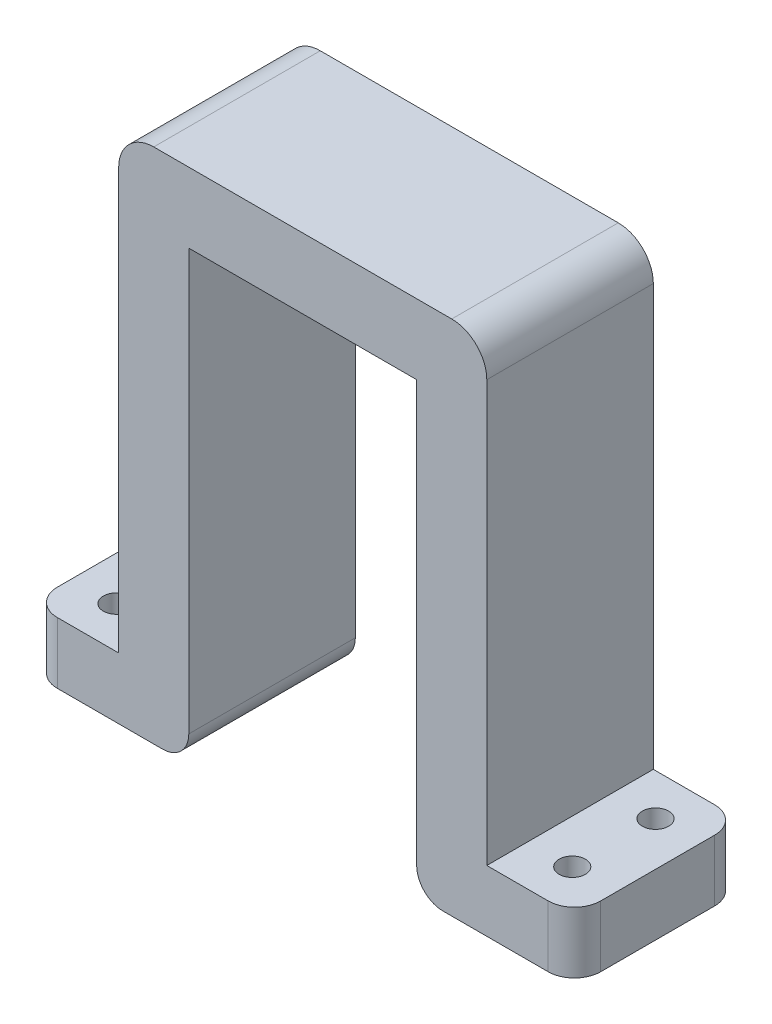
ISO-10303-21;
HEADER;
FILE_DESCRIPTION(('STEP AP214'),'2;1');
FILE_NAME('part.step','',(''),(''),'','','');
FILE_SCHEMA(('AUTOMOTIVE_DESIGN { 1 0 10303 214 1 1 1 1 }'));
ENDSEC;
DATA;
#1=APPLICATION_CONTEXT('core data for automotive mechanical design processes');
#2=APPLICATION_PROTOCOL_DEFINITION('international standard','automotive_design',2000,#1);
#3=PRODUCT_CONTEXT('',#1,'mechanical');
#4=PRODUCT('Part','Part','',(#3));
#5=PRODUCT_RELATED_PRODUCT_CATEGORY('part','',(#4));
#6=PRODUCT_DEFINITION_FORMATION('','',#4);
#7=PRODUCT_DEFINITION_CONTEXT('part definition',#1,'design');
#8=PRODUCT_DEFINITION('design','',#6,#7);
#9=PRODUCT_DEFINITION_SHAPE('','',#8);
#10=(LENGTH_UNIT() NAMED_UNIT(*) SI_UNIT(.MILLI.,.METRE.));
#11=(NAMED_UNIT(*) PLANE_ANGLE_UNIT() SI_UNIT($,.RADIAN.));
#12=(NAMED_UNIT(*) SI_UNIT($,.STERADIAN.) SOLID_ANGLE_UNIT());
#13=UNCERTAINTY_MEASURE_WITH_UNIT(LENGTH_MEASURE(1.E-05),#10,'distance_accuracy_value','');
#14=(GEOMETRIC_REPRESENTATION_CONTEXT(3) GLOBAL_UNCERTAINTY_ASSIGNED_CONTEXT((#13)) GLOBAL_UNIT_ASSIGNED_CONTEXT((#10,
#11,#12)) REPRESENTATION_CONTEXT('',''));
#15=CARTESIAN_POINT('',(0.,0.,0.));
#16=DIRECTION('',(0.,0.,1.));
#17=DIRECTION('',(1.,0.,0.));
#18=AXIS2_PLACEMENT_3D('',#15,#16,#17);
#19=CARTESIAN_POINT('',(-11.7832512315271,-43.5073891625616,19.));
#20=DIRECTION('',(0.,-1.,0.));
#21=DIRECTION('',(0.,0.,-1.));
#22=AXIS2_PLACEMENT_3D('',#19,#20,#21);
#23=PLANE('',#22);
#24=CARTESIAN_POINT('',(-24.7832512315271,-43.5073891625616,4.75));
#25=DIRECTION('',(0.,1.,0.));
#26=DIRECTION('',(0.,0.,1.));
#27=AXIS2_PLACEMENT_3D('',#24,#25,#26);
#28=CIRCLE('',#27,1.5);
#29=CARTESIAN_POINT('',(-24.7832512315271,-43.5073891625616,6.25));
#30=VERTEX_POINT('',#29);
#31=EDGE_CURVE('E643',#30,#30,#28,.T.);
#32=ORIENTED_EDGE('',*,*,#31,.T.);
#33=EDGE_LOOP('',(#32));
#34=FACE_BOUND('',#33,.T.);
#35=CARTESIAN_POINT('',(-24.7832512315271,-43.5073891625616,14.25));
#36=DIRECTION('',(0.,-1.,0.));
#37=DIRECTION('',(0.,0.,-1.));
#38=AXIS2_PLACEMENT_3D('',#35,#36,#37);
#39=CIRCLE('',#38,1.5);
#40=CARTESIAN_POINT('',(-24.7832512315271,-43.5073891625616,15.75));
#41=VERTEX_POINT('',#40);
#42=EDGE_CURVE('E634',#41,#41,#39,.T.);
#43=ORIENTED_EDGE('',*,*,#42,.F.);
#44=EDGE_LOOP('',(#43));
#45=FACE_BOUND('',#44,.T.);
#46=DIRECTION('',(-1.,0.,0.));
#47=VECTOR('',#46,1.);
#48=CARTESIAN_POINT('',(-11.7832512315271,-43.5073891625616,0.));
#49=LINE('',#48,#47);
#50=CARTESIAN_POINT('',(-14.7832512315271,-43.5073891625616,0.));
#51=VERTEX_POINT('',#50);
#52=CARTESIAN_POINT('',(-26.7832512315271,-43.5073891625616,0.));
#53=VERTEX_POINT('',#52);
#54=EDGE_CURVE('E212',#51,#53,#49,.T.);
#55=ORIENTED_EDGE('',*,*,#54,.F.);
#56=DIRECTION('',(0.,0.,-1.));
#57=VECTOR('',#56,1.);
#58=CARTESIAN_POINT('',(-14.7832512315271,-43.5073891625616,19.));
#59=LINE('',#58,#57);
#60=CARTESIAN_POINT('',(-14.7832512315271,-43.5073891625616,19.));
#61=VERTEX_POINT('',#60);
#62=EDGE_CURVE('E11',#51,#61,#59,.F.);
#63=ORIENTED_EDGE('',*,*,#62,.T.);
#64=DIRECTION('',(-1.,0.,0.));
#65=VECTOR('',#64,1.);
#66=CARTESIAN_POINT('',(-11.7832512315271,-43.5073891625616,19.));
#67=LINE('',#66,#65);
#68=CARTESIAN_POINT('',(-26.7832512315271,-43.5073891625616,19.));
#69=VERTEX_POINT('',#68);
#70=EDGE_CURVE('E233',#61,#69,#67,.T.);
#71=ORIENTED_EDGE('',*,*,#70,.T.);
#72=CARTESIAN_POINT('',(-26.7832512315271,-43.5073891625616,16.));
#73=DIRECTION('',(0.,-1.,0.));
#74=DIRECTION('',(0.,0.,-1.));
#75=AXIS2_PLACEMENT_3D('',#72,#73,#74);
#76=CIRCLE('',#75,3.);
#77=CARTESIAN_POINT('',(-29.7832512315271,-43.5073891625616,16.));
#78=VERTEX_POINT('',#77);
#79=EDGE_CURVE('E267',#69,#78,#76,.T.);
#80=ORIENTED_EDGE('',*,*,#79,.T.);
#81=DIRECTION('',(0.,0.,1.));
#82=VECTOR('',#81,1.);
#83=CARTESIAN_POINT('',(-29.7832512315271,-43.5073891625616,0.));
#84=LINE('',#83,#82);
#85=CARTESIAN_POINT('',(-29.7832512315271,-43.5073891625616,3.));
#86=VERTEX_POINT('',#85);
#87=EDGE_CURVE('E351',#86,#78,#84,.T.);
#88=ORIENTED_EDGE('',*,*,#87,.F.);
#89=CARTESIAN_POINT('',(-26.7832512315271,-43.5073891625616,3.));
#90=DIRECTION('',(0.,-1.,0.));
#91=DIRECTION('',(0.,0.,-1.));
#92=AXIS2_PLACEMENT_3D('',#89,#90,#91);
#93=CIRCLE('',#92,3.);
#94=EDGE_CURVE('E269',#86,#53,#93,.T.);
#95=ORIENTED_EDGE('',*,*,#94,.T.);
#96=EDGE_LOOP('',(#55,#63,#71,#80,#88,#95));
#97=FACE_BOUND('',#96,.T.);
#98=ADVANCED_FACE('F33',(#34,#45,#97),#23,.T.);
#99=CARTESIAN_POINT('',(-11.7832512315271,7.49261083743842,19.));
#100=DIRECTION('',(1.,0.,0.));
#101=DIRECTION('',(0.,1.,0.));
#102=AXIS2_PLACEMENT_3D('',#99,#100,#101);
#103=PLANE('',#102);
#104=DIRECTION('',(0.,-1.,0.));
#105=VECTOR('',#104,1.);
#106=CARTESIAN_POINT('',(-11.7832512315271,7.49261083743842,19.));
#107=LINE('',#106,#105);
#108=CARTESIAN_POINT('',(-11.7832512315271,7.49261083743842,19.));
#109=VERTEX_POINT('',#108);
#110=CARTESIAN_POINT('',(-11.7832512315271,-40.5073891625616,19.));
#111=VERTEX_POINT('',#110);
#112=EDGE_CURVE('E209',#109,#111,#107,.T.);
#113=ORIENTED_EDGE('',*,*,#112,.T.);
#114=DIRECTION('',(0.,0.,-1.));
#115=VECTOR('',#114,1.);
#116=CARTESIAN_POINT('',(-11.7832512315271,-40.5073891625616,19.));
#117=LINE('',#116,#115);
#118=CARTESIAN_POINT('',(-11.7832512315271,-40.5073891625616,0.));
#119=VERTEX_POINT('',#118);
#120=EDGE_CURVE('E41',#111,#119,#117,.T.);
#121=ORIENTED_EDGE('',*,*,#120,.T.);
#122=DIRECTION('',(0.,-1.,0.));
#123=VECTOR('',#122,1.);
#124=CARTESIAN_POINT('',(-11.7832512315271,7.49261083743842,0.));
#125=LINE('',#124,#123);
#126=CARTESIAN_POINT('',(-11.7832512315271,7.49261083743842,0.));
#127=VERTEX_POINT('',#126);
#128=EDGE_CURVE('E230',#127,#119,#125,.T.);
#129=ORIENTED_EDGE('',*,*,#128,.F.);
#130=DIRECTION('',(0.,0.,-1.));
#131=VECTOR('',#130,1.);
#132=CARTESIAN_POINT('',(-11.7832512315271,7.49261083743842,19.));
#133=LINE('',#132,#131);
#134=EDGE_CURVE('E234',#109,#127,#133,.T.);
#135=ORIENTED_EDGE('',*,*,#134,.F.);
#136=EDGE_LOOP('',(#113,#121,#129,#135));
#137=FACE_BOUND('',#136,.T.);
#138=ADVANCED_FACE('F308',(#137),#103,.T.);
#139=CARTESIAN_POINT('',(-11.7832512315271,7.49261083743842,19.));
#140=DIRECTION('',(0.,1.,0.));
#141=DIRECTION('',(0.,0.,1.));
#142=AXIS2_PLACEMENT_3D('',#139,#140,#141);
#143=PLANE('',#142);
#144=DIRECTION('',(1.,0.,0.));
#145=VECTOR('',#144,1.);
#146=CARTESIAN_POINT('',(-11.7832512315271,7.49261083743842,0.));
#147=LINE('',#146,#145);
#148=CARTESIAN_POINT('',(14.2167487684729,7.49261083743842,0.));
#149=VERTEX_POINT('',#148);
#150=EDGE_CURVE('E228',#127,#149,#147,.T.);
#151=ORIENTED_EDGE('',*,*,#150,.T.);
#152=DIRECTION('',(0.,0.,-1.));
#153=VECTOR('',#152,1.);
#154=CARTESIAN_POINT('',(14.2167487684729,7.49261083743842,19.));
#155=LINE('',#154,#153);
#156=CARTESIAN_POINT('',(14.2167487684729,7.49261083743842,19.));
#157=VERTEX_POINT('',#156);
#158=EDGE_CURVE('E211',#157,#149,#155,.T.);
#159=ORIENTED_EDGE('',*,*,#158,.F.);
#160=DIRECTION('',(1.,0.,0.));
#161=VECTOR('',#160,1.);
#162=CARTESIAN_POINT('',(-11.7832512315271,7.49261083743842,19.));
#163=LINE('',#162,#161);
#164=EDGE_CURVE('E207',#109,#157,#163,.T.);
#165=ORIENTED_EDGE('',*,*,#164,.F.);
#166=ORIENTED_EDGE('',*,*,#134,.T.);
#167=EDGE_LOOP('',(#151,#159,#165,#166));
#168=FACE_BOUND('',#167,.T.);
#169=ADVANCED_FACE('F317',(#168),#143,.F.);
#170=CARTESIAN_POINT('',(14.2167487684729,7.49261083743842,19.));
#171=DIRECTION('',(1.,0.,0.));
#172=DIRECTION('',(0.,1.,0.));
#173=AXIS2_PLACEMENT_3D('',#170,#171,#172);
#174=PLANE('',#173);
#175=DIRECTION('',(0.,-1.,0.));
#176=VECTOR('',#175,1.);
#177=CARTESIAN_POINT('',(14.2167487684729,7.49261083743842,0.));
#178=LINE('',#177,#176);
#179=CARTESIAN_POINT('',(14.2167487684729,-40.5073891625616,0.));
#180=VERTEX_POINT('',#179);
#181=EDGE_CURVE('E225',#149,#180,#178,.T.);
#182=ORIENTED_EDGE('',*,*,#181,.T.);
#183=DIRECTION('',(0.,0.,-1.));
#184=VECTOR('',#183,1.);
#185=CARTESIAN_POINT('',(14.2167487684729,-40.5073891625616,19.));
#186=LINE('',#185,#184);
#187=CARTESIAN_POINT('',(14.2167487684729,-40.5073891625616,19.));
#188=VERTEX_POINT('',#187);
#189=EDGE_CURVE('E300',#180,#188,#186,.F.);
#190=ORIENTED_EDGE('',*,*,#189,.T.);
#191=DIRECTION('',(0.,-1.,0.));
#192=VECTOR('',#191,1.);
#193=CARTESIAN_POINT('',(14.2167487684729,7.49261083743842,19.));
#194=LINE('',#193,#192);
#195=EDGE_CURVE('E199',#157,#188,#194,.T.);
#196=ORIENTED_EDGE('',*,*,#195,.F.);
#197=ORIENTED_EDGE('',*,*,#158,.T.);
#198=EDGE_LOOP('',(#182,#190,#196,#197));
#199=FACE_BOUND('',#198,.T.);
#200=ADVANCED_FACE('F321',(#199),#174,.F.);
#201=CARTESIAN_POINT('',(14.2167487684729,-43.5073891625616,19.));
#202=DIRECTION('',(0.,1.,0.));
#203=DIRECTION('',(0.,0.,1.));
#204=AXIS2_PLACEMENT_3D('',#201,#202,#203);
#205=PLANE('',#204);
#206=CARTESIAN_POINT('',(27.2167487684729,-43.5073891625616,4.75));
#207=DIRECTION('',(0.,1.,0.));
#208=DIRECTION('',(0.,0.,-1.));
#209=AXIS2_PLACEMENT_3D('',#206,#207,#208);
#210=CIRCLE('',#209,1.5);
#211=CARTESIAN_POINT('',(27.2167487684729,-43.5073891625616,6.25));
#212=VERTEX_POINT('',#211);
#213=EDGE_CURVE('E628',#212,#212,#210,.T.);
#214=ORIENTED_EDGE('',*,*,#213,.T.);
#215=EDGE_LOOP('',(#214));
#216=FACE_BOUND('',#215,.T.);
#217=CARTESIAN_POINT('',(27.2167487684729,-43.5073891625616,14.25));
#218=DIRECTION('',(0.,1.,0.));
#219=DIRECTION('',(0.,0.,1.));
#220=AXIS2_PLACEMENT_3D('',#217,#218,#219);
#221=CIRCLE('',#220,1.5);
#222=CARTESIAN_POINT('',(27.2167487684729,-43.5073891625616,15.75));
#223=VERTEX_POINT('',#222);
#224=EDGE_CURVE('E191',#223,#223,#221,.T.);
#225=ORIENTED_EDGE('',*,*,#224,.T.);
#226=EDGE_LOOP('',(#225));
#227=FACE_BOUND('',#226,.T.);
#228=DIRECTION('',(1.,0.,0.));
#229=VECTOR('',#228,1.);
#230=CARTESIAN_POINT('',(14.2167487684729,-43.5073891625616,19.));
#231=LINE('',#230,#229);
#232=CARTESIAN_POINT('',(17.2167487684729,-43.5073891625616,19.));
#233=VERTEX_POINT('',#232);
#234=CARTESIAN_POINT('',(29.2167487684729,-43.5073891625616,19.));
#235=VERTEX_POINT('',#234);
#236=EDGE_CURVE('E196',#233,#235,#231,.T.);
#237=ORIENTED_EDGE('',*,*,#236,.F.);
#238=DIRECTION('',(0.,0.,-1.));
#239=VECTOR('',#238,1.);
#240=CARTESIAN_POINT('',(17.2167487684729,-43.5073891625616,19.));
#241=LINE('',#240,#239);
#242=CARTESIAN_POINT('',(17.2167487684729,-43.5073891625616,0.));
#243=VERTEX_POINT('',#242);
#244=EDGE_CURVE('E293',#233,#243,#241,.T.);
#245=ORIENTED_EDGE('',*,*,#244,.T.);
#246=DIRECTION('',(1.,0.,0.));
#247=VECTOR('',#246,1.);
#248=CARTESIAN_POINT('',(14.2167487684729,-43.5073891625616,0.));
#249=LINE('',#248,#247);
#250=CARTESIAN_POINT('',(29.2167487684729,-43.5073891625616,0.));
#251=VERTEX_POINT('',#250);
#252=EDGE_CURVE('E223',#243,#251,#249,.T.);
#253=ORIENTED_EDGE('',*,*,#252,.T.);
#254=CARTESIAN_POINT('',(29.2167487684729,-43.5073891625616,3.));
#255=DIRECTION('',(0.,1.,0.));
#256=DIRECTION('',(0.,0.,1.));
#257=AXIS2_PLACEMENT_3D('',#254,#255,#256);
#258=CIRCLE('',#257,3.);
#259=CARTESIAN_POINT('',(32.2167487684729,-43.5073891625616,3.));
#260=VERTEX_POINT('',#259);
#261=EDGE_CURVE('E251',#251,#260,#258,.F.);
#262=ORIENTED_EDGE('',*,*,#261,.T.);
#263=DIRECTION('',(0.,0.,-1.));
#264=VECTOR('',#263,1.);
#265=CARTESIAN_POINT('',(32.2167487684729,-43.5073891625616,19.));
#266=LINE('',#265,#264);
#267=CARTESIAN_POINT('',(32.2167487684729,-43.5073891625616,16.));
#268=VERTEX_POINT('',#267);
#269=EDGE_CURVE('E190',#268,#260,#266,.T.);
#270=ORIENTED_EDGE('',*,*,#269,.F.);
#271=CARTESIAN_POINT('',(29.2167487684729,-43.5073891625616,16.));
#272=DIRECTION('',(0.,1.,0.));
#273=DIRECTION('',(0.,0.,1.));
#274=AXIS2_PLACEMENT_3D('',#271,#272,#273);
#275=CIRCLE('',#274,3.);
#276=EDGE_CURVE('E253',#268,#235,#275,.F.);
#277=ORIENTED_EDGE('',*,*,#276,.T.);
#278=EDGE_LOOP('',(#237,#245,#253,#262,#270,#277));
#279=FACE_BOUND('',#278,.T.);
#280=ADVANCED_FACE('F329',(#216,#227,#279),#205,.F.);
#281=CARTESIAN_POINT('',(22.2167487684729,-43.5073891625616,19.));
#282=DIRECTION('',(-1.,0.,0.));
#283=DIRECTION('',(0.,0.,1.));
#284=AXIS2_PLACEMENT_3D('',#281,#282,#283);
#285=PLANE('',#284);
#286=DIRECTION('',(0.,1.,0.));
#287=VECTOR('',#286,1.);
#288=CARTESIAN_POINT('',(22.2167487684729,-43.5073891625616,0.));
#289=LINE('',#288,#287);
#290=CARTESIAN_POINT('',(22.2167487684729,-36.5073891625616,0.));
#291=VERTEX_POINT('',#290);
#292=CARTESIAN_POINT('',(22.2167487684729,11.4926108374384,0.));
#293=VERTEX_POINT('',#292);
#294=EDGE_CURVE('E221',#291,#293,#289,.T.);
#295=ORIENTED_EDGE('',*,*,#294,.T.);
#296=DIRECTION('',(0.,0.,-1.));
#297=VECTOR('',#296,1.);
#298=CARTESIAN_POINT('',(22.2167487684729,11.4926108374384,19.));
#299=LINE('',#298,#297);
#300=CARTESIAN_POINT('',(22.2167487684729,11.4926108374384,19.));
#301=VERTEX_POINT('',#300);
#302=EDGE_CURVE('E195',#293,#301,#299,.F.);
#303=ORIENTED_EDGE('',*,*,#302,.T.);
#304=DIRECTION('',(0.,1.,0.));
#305=VECTOR('',#304,1.);
#306=CARTESIAN_POINT('',(22.2167487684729,-43.5073891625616,19.));
#307=LINE('',#306,#305);
#308=CARTESIAN_POINT('',(22.2167487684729,-36.5073891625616,19.));
#309=VERTEX_POINT('',#308);
#310=EDGE_CURVE('E175',#309,#301,#307,.T.);
#311=ORIENTED_EDGE('',*,*,#310,.F.);
#312=DIRECTION('',(0.,0.,-1.));
#313=VECTOR('',#312,1.);
#314=CARTESIAN_POINT('',(22.2167487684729,-36.5073891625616,19.));
#315=LINE('',#314,#313);
#316=EDGE_CURVE('E184',#309,#291,#315,.T.);
#317=ORIENTED_EDGE('',*,*,#316,.T.);
#318=EDGE_LOOP('',(#295,#303,#311,#317));
#319=FACE_BOUND('',#318,.T.);
#320=ADVANCED_FACE('F193',(#319),#285,.F.);
#321=CARTESIAN_POINT('',(22.2167487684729,15.4926108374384,19.));
#322=DIRECTION('',(0.,-1.,0.));
#323=DIRECTION('',(0.,0.,-1.));
#324=AXIS2_PLACEMENT_3D('',#321,#322,#323);
#325=PLANE('',#324);
#326=DIRECTION('',(-1.,0.,0.));
#327=VECTOR('',#326,1.);
#328=CARTESIAN_POINT('',(22.2167487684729,15.4926108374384,0.));
#329=LINE('',#328,#327);
#330=CARTESIAN_POINT('',(18.2167487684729,15.4926108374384,0.));
#331=VERTEX_POINT('',#330);
#332=CARTESIAN_POINT('',(-15.7832512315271,15.4926108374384,0.));
#333=VERTEX_POINT('',#332);
#334=EDGE_CURVE('E218',#331,#333,#329,.T.);
#335=ORIENTED_EDGE('',*,*,#334,.T.);
#336=DIRECTION('',(0.,0.,-1.));
#337=VECTOR('',#336,1.);
#338=CARTESIAN_POINT('',(-15.7832512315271,15.4926108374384,19.));
#339=LINE('',#338,#337);
#340=CARTESIAN_POINT('',(-15.7832512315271,15.4926108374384,19.));
#341=VERTEX_POINT('',#340);
#342=EDGE_CURVE('E286',#333,#341,#339,.F.);
#343=ORIENTED_EDGE('',*,*,#342,.T.);
#344=DIRECTION('',(-1.,0.,0.));
#345=VECTOR('',#344,1.);
#346=CARTESIAN_POINT('',(22.2167487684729,15.4926108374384,19.));
#347=LINE('',#346,#345);
#348=CARTESIAN_POINT('',(18.2167487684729,15.4926108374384,19.));
#349=VERTEX_POINT('',#348);
#350=EDGE_CURVE('E197',#349,#341,#347,.T.);
#351=ORIENTED_EDGE('',*,*,#350,.F.);
#352=DIRECTION('',(0.,0.,-1.));
#353=VECTOR('',#352,1.);
#354=CARTESIAN_POINT('',(18.2167487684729,15.4926108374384,19.));
#355=LINE('',#354,#353);
#356=EDGE_CURVE('E283',#349,#331,#355,.T.);
#357=ORIENTED_EDGE('',*,*,#356,.T.);
#358=EDGE_LOOP('',(#335,#343,#351,#357));
#359=FACE_BOUND('',#358,.T.);
#360=ADVANCED_FACE('F376',(#359),#325,.F.);
#361=CARTESIAN_POINT('',(-19.7832512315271,-43.5073891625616,19.));
#362=DIRECTION('',(-1.,0.,0.));
#363=DIRECTION('',(0.,0.,1.));
#364=AXIS2_PLACEMENT_3D('',#361,#362,#363);
#365=PLANE('',#364);
#366=DIRECTION('',(0.,1.,0.));
#367=VECTOR('',#366,1.);
#368=CARTESIAN_POINT('',(-19.7832512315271,-43.5073891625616,19.));
#369=LINE('',#368,#367);
#370=CARTESIAN_POINT('',(-19.7832512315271,-36.5073891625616,19.));
#371=VERTEX_POINT('',#370);
#372=CARTESIAN_POINT('',(-19.7832512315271,11.4926108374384,19.));
#373=VERTEX_POINT('',#372);
#374=EDGE_CURVE('E202',#371,#373,#369,.T.);
#375=ORIENTED_EDGE('',*,*,#374,.T.);
#376=DIRECTION('',(0.,0.,-1.));
#377=VECTOR('',#376,1.);
#378=CARTESIAN_POINT('',(-19.7832512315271,11.4926108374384,0.));
#379=LINE('',#378,#377);
#380=CARTESIAN_POINT('',(-19.7832512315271,11.4926108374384,0.));
#381=VERTEX_POINT('',#380);
#382=EDGE_CURVE('E276',#373,#381,#379,.T.);
#383=ORIENTED_EDGE('',*,*,#382,.T.);
#384=DIRECTION('',(0.,1.,0.));
#385=VECTOR('',#384,1.);
#386=CARTESIAN_POINT('',(-19.7832512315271,-43.5073891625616,0.));
#387=LINE('',#386,#385);
#388=CARTESIAN_POINT('',(-19.7832512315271,-36.5073891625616,0.));
#389=VERTEX_POINT('',#388);
#390=EDGE_CURVE('E214',#389,#381,#387,.T.);
#391=ORIENTED_EDGE('',*,*,#390,.F.);
#392=DIRECTION('',(0.,0.,-1.));
#393=VECTOR('',#392,1.);
#394=CARTESIAN_POINT('',(-19.7832512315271,-36.5073891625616,0.));
#395=LINE('',#394,#393);
#396=EDGE_CURVE('E350',#371,#389,#395,.T.);
#397=ORIENTED_EDGE('',*,*,#396,.F.);
#398=EDGE_LOOP('',(#375,#383,#391,#397));
#399=FACE_BOUND('',#398,.T.);
#400=ADVANCED_FACE('F367',(#399),#365,.T.);
#401=CARTESIAN_POINT('',(0.,0.,19.));
#402=DIRECTION('',(0.,0.,-1.));
#403=DIRECTION('',(-1.,0.,0.));
#404=AXIS2_PLACEMENT_3D('',#401,#402,#403);
#405=PLANE('',#404);
#406=ORIENTED_EDGE('',*,*,#195,.T.);
#407=CARTESIAN_POINT('',(17.2167487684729,-40.5073891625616,19.));
#408=DIRECTION('',(0.,0.,-1.));
#409=DIRECTION('',(-1.,0.,0.));
#410=AXIS2_PLACEMENT_3D('',#407,#408,#409);
#411=CIRCLE('',#410,3.);
#412=EDGE_CURVE('E303',#188,#233,#411,.F.);
#413=ORIENTED_EDGE('',*,*,#412,.T.);
#414=ORIENTED_EDGE('',*,*,#236,.T.);
#415=DIRECTION('',(0.,1.,0.));
#416=VECTOR('',#415,1.);
#417=CARTESIAN_POINT('',(29.2167487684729,-36.5073891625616,19.));
#418=LINE('',#417,#416);
#419=CARTESIAN_POINT('',(29.2167487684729,-36.5073891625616,19.));
#420=VERTEX_POINT('',#419);
#421=EDGE_CURVE('E178',#235,#420,#418,.T.);
#422=ORIENTED_EDGE('',*,*,#421,.T.);
#423=DIRECTION('',(-1.,0.,0.));
#424=VECTOR('',#423,1.);
#425=CARTESIAN_POINT('',(32.2167487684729,-36.5073891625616,19.));
#426=LINE('',#425,#424);
#427=EDGE_CURVE('E170',#420,#309,#426,.T.);
#428=ORIENTED_EDGE('',*,*,#427,.T.);
#429=ORIENTED_EDGE('',*,*,#310,.T.);
#430=CARTESIAN_POINT('',(18.2167487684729,11.4926108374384,19.));
#431=DIRECTION('',(0.,0.,-1.));
#432=DIRECTION('',(-1.,0.,0.));
#433=AXIS2_PLACEMENT_3D('',#430,#431,#432);
#434=CIRCLE('',#433,4.);
#435=EDGE_CURVE('E288',#301,#349,#434,.F.);
#436=ORIENTED_EDGE('',*,*,#435,.T.);
#437=ORIENTED_EDGE('',*,*,#350,.T.);
#438=CARTESIAN_POINT('',(-15.7832512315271,11.4926108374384,19.));
#439=DIRECTION('',(0.,0.,-1.));
#440=DIRECTION('',(-1.,0.,0.));
#441=AXIS2_PLACEMENT_3D('',#438,#439,#440);
#442=CIRCLE('',#441,4.);
#443=EDGE_CURVE('E290',#341,#373,#442,.F.);
#444=ORIENTED_EDGE('',*,*,#443,.T.);
#445=ORIENTED_EDGE('',*,*,#374,.F.);
#446=DIRECTION('',(1.,0.,0.));
#447=VECTOR('',#446,1.);
#448=CARTESIAN_POINT('',(-29.7832512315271,-36.5073891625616,19.));
#449=LINE('',#448,#447);
#450=CARTESIAN_POINT('',(-26.7832512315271,-36.5073891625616,19.));
#451=VERTEX_POINT('',#450);
#452=EDGE_CURVE('E215',#451,#371,#449,.T.);
#453=ORIENTED_EDGE('',*,*,#452,.F.);
#454=DIRECTION('',(0.,1.,0.));
#455=VECTOR('',#454,1.);
#456=CARTESIAN_POINT('',(-26.7832512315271,0.,19.));
#457=LINE('',#456,#455);
#458=EDGE_CURVE('E236',#451,#69,#457,.F.);
#459=ORIENTED_EDGE('',*,*,#458,.T.);
#460=ORIENTED_EDGE('',*,*,#70,.F.);
#461=CARTESIAN_POINT('',(-14.7832512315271,-40.5073891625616,19.));
#462=DIRECTION('',(0.,0.,-1.));
#463=DIRECTION('',(-1.,0.,0.));
#464=AXIS2_PLACEMENT_3D('',#461,#462,#463);
#465=CIRCLE('',#464,3.);
#466=EDGE_CURVE('E48',#61,#111,#465,.F.);
#467=ORIENTED_EDGE('',*,*,#466,.T.);
#468=ORIENTED_EDGE('',*,*,#112,.F.);
#469=ORIENTED_EDGE('',*,*,#164,.T.);
#470=EDGE_LOOP('',(#406,#413,#414,#422,#428,#429,#436,#437,#444,#445,#453,#459,#460,#467,#468,#469));
#471=FACE_BOUND('',#470,.T.);
#472=ADVANCED_FACE('F173',(#471),#405,.F.);
#473=CARTESIAN_POINT('',(0.,0.,0.));
#474=DIRECTION('',(0.,0.,-1.));
#475=DIRECTION('',(-1.,0.,0.));
#476=AXIS2_PLACEMENT_3D('',#473,#474,#475);
#477=PLANE('',#476);
#478=ORIENTED_EDGE('',*,*,#252,.F.);
#479=CARTESIAN_POINT('',(17.2167487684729,-40.5073891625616,0.));
#480=DIRECTION('',(0.,0.,-1.));
#481=DIRECTION('',(-1.,0.,0.));
#482=AXIS2_PLACEMENT_3D('',#479,#480,#481);
#483=CIRCLE('',#482,3.);
#484=EDGE_CURVE('E298',#243,#180,#483,.T.);
#485=ORIENTED_EDGE('',*,*,#484,.T.);
#486=ORIENTED_EDGE('',*,*,#181,.F.);
#487=ORIENTED_EDGE('',*,*,#150,.F.);
#488=ORIENTED_EDGE('',*,*,#128,.T.);
#489=CARTESIAN_POINT('',(-14.7832512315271,-40.5073891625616,0.));
#490=DIRECTION('',(0.,0.,-1.));
#491=DIRECTION('',(-1.,0.,0.));
#492=AXIS2_PLACEMENT_3D('',#489,#490,#491);
#493=CIRCLE('',#492,3.);
#494=EDGE_CURVE('E296',#119,#51,#493,.T.);
#495=ORIENTED_EDGE('',*,*,#494,.T.);
#496=ORIENTED_EDGE('',*,*,#54,.T.);
#497=DIRECTION('',(0.,-1.,0.));
#498=VECTOR('',#497,1.);
#499=CARTESIAN_POINT('',(-26.7832512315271,-36.5073891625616,0.));
#500=LINE('',#499,#498);
#501=CARTESIAN_POINT('',(-26.7832512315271,-36.5073891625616,0.));
#502=VERTEX_POINT('',#501);
#503=EDGE_CURVE('E256',#53,#502,#500,.F.);
#504=ORIENTED_EDGE('',*,*,#503,.T.);
#505=DIRECTION('',(1.,0.,0.));
#506=VECTOR('',#505,1.);
#507=CARTESIAN_POINT('',(-29.7832512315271,-36.5073891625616,0.));
#508=LINE('',#507,#506);
#509=EDGE_CURVE('E357',#502,#389,#508,.T.);
#510=ORIENTED_EDGE('',*,*,#509,.T.);
#511=ORIENTED_EDGE('',*,*,#390,.T.);
#512=CARTESIAN_POINT('',(-15.7832512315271,11.4926108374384,0.));
#513=DIRECTION('',(0.,0.,-1.));
#514=DIRECTION('',(-1.,0.,0.));
#515=AXIS2_PLACEMENT_3D('',#512,#513,#514);
#516=CIRCLE('',#515,4.);
#517=EDGE_CURVE('E281',#381,#333,#516,.T.);
#518=ORIENTED_EDGE('',*,*,#517,.T.);
#519=ORIENTED_EDGE('',*,*,#334,.F.);
#520=CARTESIAN_POINT('',(18.2167487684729,11.4926108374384,0.));
#521=DIRECTION('',(0.,0.,-1.));
#522=DIRECTION('',(-1.,0.,0.));
#523=AXIS2_PLACEMENT_3D('',#520,#521,#522);
#524=CIRCLE('',#523,4.);
#525=EDGE_CURVE('E279',#331,#293,#524,.T.);
#526=ORIENTED_EDGE('',*,*,#525,.T.);
#527=ORIENTED_EDGE('',*,*,#294,.F.);
#528=DIRECTION('',(-1.,0.,0.));
#529=VECTOR('',#528,1.);
#530=CARTESIAN_POINT('',(32.2167487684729,-36.5073891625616,0.));
#531=LINE('',#530,#529);
#532=CARTESIAN_POINT('',(29.2167487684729,-36.5073891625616,0.));
#533=VERTEX_POINT('',#532);
#534=EDGE_CURVE('E180',#533,#291,#531,.T.);
#535=ORIENTED_EDGE('',*,*,#534,.F.);
#536=DIRECTION('',(0.,1.,0.));
#537=VECTOR('',#536,1.);
#538=CARTESIAN_POINT('',(29.2167487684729,0.,0.));
#539=LINE('',#538,#537);
#540=EDGE_CURVE('E258',#533,#251,#539,.F.);
#541=ORIENTED_EDGE('',*,*,#540,.T.);
#542=EDGE_LOOP('',(#478,#485,#486,#487,#488,#495,#496,#504,#510,#511,#518,#519,#526,#527,#535,#541));
#543=FACE_BOUND('',#542,.T.);
#544=ADVANCED_FACE('F313',(#543),#477,.T.);
#545=CARTESIAN_POINT('',(-29.7832512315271,-36.5073891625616,0.));
#546=DIRECTION('',(0.,-1.,0.));
#547=DIRECTION('',(0.,0.,-1.));
#548=AXIS2_PLACEMENT_3D('',#545,#546,#547);
#549=PLANE('',#548);
#550=CARTESIAN_POINT('',(-24.7832512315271,-36.5073891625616,4.75));
#551=DIRECTION('',(0.,1.,0.));
#552=DIRECTION('',(0.,0.,1.));
#553=AXIS2_PLACEMENT_3D('',#550,#551,#552);
#554=CIRCLE('',#553,1.5);
#555=CARTESIAN_POINT('',(-24.7832512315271,-36.5073891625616,6.25));
#556=VERTEX_POINT('',#555);
#557=EDGE_CURVE('E640',#556,#556,#554,.T.);
#558=ORIENTED_EDGE('',*,*,#557,.F.);
#559=EDGE_LOOP('',(#558));
#560=FACE_BOUND('',#559,.T.);
#561=CARTESIAN_POINT('',(-24.7832512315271,-36.5073891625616,14.25));
#562=DIRECTION('',(0.,-1.,0.));
#563=DIRECTION('',(0.,0.,-1.));
#564=AXIS2_PLACEMENT_3D('',#561,#562,#563);
#565=CIRCLE('',#564,1.5);
#566=CARTESIAN_POINT('',(-24.7832512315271,-36.5073891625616,15.75));
#567=VERTEX_POINT('',#566);
#568=EDGE_CURVE('E637',#567,#567,#565,.T.);
#569=ORIENTED_EDGE('',*,*,#568,.T.);
#570=EDGE_LOOP('',(#569));
#571=FACE_BOUND('',#570,.T.);
#572=ORIENTED_EDGE('',*,*,#509,.F.);
#573=CARTESIAN_POINT('',(-26.7832512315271,-36.5073891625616,3.));
#574=DIRECTION('',(0.,-1.,0.));
#575=DIRECTION('',(0.,0.,-1.));
#576=AXIS2_PLACEMENT_3D('',#573,#574,#575);
#577=CIRCLE('',#576,3.);
#578=CARTESIAN_POINT('',(-29.7832512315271,-36.5073891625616,3.));
#579=VERTEX_POINT('',#578);
#580=EDGE_CURVE('E274',#502,#579,#577,.F.);
#581=ORIENTED_EDGE('',*,*,#580,.T.);
#582=DIRECTION('',(0.,0.,-1.));
#583=VECTOR('',#582,1.);
#584=CARTESIAN_POINT('',(-29.7832512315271,-36.5073891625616,0.));
#585=LINE('',#584,#583);
#586=CARTESIAN_POINT('',(-29.7832512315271,-36.5073891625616,16.));
#587=VERTEX_POINT('',#586);
#588=EDGE_CURVE('E354',#587,#579,#585,.T.);
#589=ORIENTED_EDGE('',*,*,#588,.F.);
#590=CARTESIAN_POINT('',(-26.7832512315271,-36.5073891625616,16.));
#591=DIRECTION('',(0.,-1.,0.));
#592=DIRECTION('',(0.,0.,-1.));
#593=AXIS2_PLACEMENT_3D('',#590,#591,#592);
#594=CIRCLE('',#593,3.);
#595=EDGE_CURVE('E272',#587,#451,#594,.F.);
#596=ORIENTED_EDGE('',*,*,#595,.T.);
#597=ORIENTED_EDGE('',*,*,#452,.T.);
#598=ORIENTED_EDGE('',*,*,#396,.T.);
#599=EDGE_LOOP('',(#572,#581,#589,#596,#597,#598));
#600=FACE_BOUND('',#599,.T.);
#601=ADVANCED_FACE('F443',(#560,#571,#600),#549,.F.);
#602=CARTESIAN_POINT('',(-29.7832512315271,0.,0.));
#603=DIRECTION('',(1.,0.,0.));
#604=DIRECTION('',(0.,0.,-1.));
#605=AXIS2_PLACEMENT_3D('',#602,#603,#604);
#606=PLANE('',#605);
#607=ORIENTED_EDGE('',*,*,#588,.T.);
#608=DIRECTION('',(0.,-1.,0.));
#609=VECTOR('',#608,1.);
#610=CARTESIAN_POINT('',(-29.7832512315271,-43.5073891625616,3.));
#611=LINE('',#610,#609);
#612=EDGE_CURVE('E264',#579,#86,#611,.T.);
#613=ORIENTED_EDGE('',*,*,#612,.T.);
#614=ORIENTED_EDGE('',*,*,#87,.T.);
#615=DIRECTION('',(0.,1.,0.));
#616=VECTOR('',#615,1.);
#617=CARTESIAN_POINT('',(-29.7832512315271,0.,16.));
#618=LINE('',#617,#616);
#619=EDGE_CURVE('E261',#78,#587,#618,.T.);
#620=ORIENTED_EDGE('',*,*,#619,.T.);
#621=EDGE_LOOP('',(#607,#613,#614,#620));
#622=FACE_BOUND('',#621,.T.);
#623=ADVANCED_FACE('F421',(#622),#606,.F.);
#624=CARTESIAN_POINT('',(32.2167487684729,-36.5073891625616,19.));
#625=DIRECTION('',(0.,1.,0.));
#626=DIRECTION('',(0.,0.,1.));
#627=AXIS2_PLACEMENT_3D('',#624,#625,#626);
#628=PLANE('',#627);
#629=CARTESIAN_POINT('',(27.2167487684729,-36.5073891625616,4.75));
#630=DIRECTION('',(0.,1.,0.));
#631=DIRECTION('',(0.,0.,-1.));
#632=AXIS2_PLACEMENT_3D('',#629,#630,#631);
#633=CIRCLE('',#632,1.5);
#634=CARTESIAN_POINT('',(27.2167487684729,-36.5073891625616,6.25));
#635=VERTEX_POINT('',#634);
#636=EDGE_CURVE('E630',#635,#635,#633,.T.);
#637=ORIENTED_EDGE('',*,*,#636,.F.);
#638=EDGE_LOOP('',(#637));
#639=FACE_BOUND('',#638,.T.);
#640=CARTESIAN_POINT('',(27.2167487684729,-36.5073891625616,14.25));
#641=DIRECTION('',(0.,1.,0.));
#642=DIRECTION('',(0.,0.,1.));
#643=AXIS2_PLACEMENT_3D('',#640,#641,#642);
#644=CIRCLE('',#643,1.5);
#645=CARTESIAN_POINT('',(27.2167487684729,-36.5073891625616,15.75));
#646=VERTEX_POINT('',#645);
#647=EDGE_CURVE('E346',#646,#646,#644,.T.);
#648=ORIENTED_EDGE('',*,*,#647,.F.);
#649=EDGE_LOOP('',(#648));
#650=FACE_BOUND('',#649,.T.);
#651=ORIENTED_EDGE('',*,*,#427,.F.);
#652=CARTESIAN_POINT('',(29.2167487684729,-36.5073891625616,16.));
#653=DIRECTION('',(0.,1.,0.));
#654=DIRECTION('',(0.,0.,1.));
#655=AXIS2_PLACEMENT_3D('',#652,#653,#654);
#656=CIRCLE('',#655,3.);
#657=CARTESIAN_POINT('',(32.2167487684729,-36.5073891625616,16.));
#658=VERTEX_POINT('',#657);
#659=EDGE_CURVE('E244',#420,#658,#656,.T.);
#660=ORIENTED_EDGE('',*,*,#659,.T.);
#661=DIRECTION('',(0.,0.,-1.));
#662=VECTOR('',#661,1.);
#663=CARTESIAN_POINT('',(32.2167487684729,-36.5073891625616,19.));
#664=LINE('',#663,#662);
#665=CARTESIAN_POINT('',(32.2167487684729,-36.5073891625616,3.));
#666=VERTEX_POINT('',#665);
#667=EDGE_CURVE('E181',#658,#666,#664,.T.);
#668=ORIENTED_EDGE('',*,*,#667,.T.);
#669=CARTESIAN_POINT('',(29.2167487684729,-36.5073891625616,3.));
#670=DIRECTION('',(0.,1.,0.));
#671=DIRECTION('',(0.,0.,1.));
#672=AXIS2_PLACEMENT_3D('',#669,#670,#671);
#673=CIRCLE('',#672,3.);
#674=EDGE_CURVE('E242',#666,#533,#673,.T.);
#675=ORIENTED_EDGE('',*,*,#674,.T.);
#676=ORIENTED_EDGE('',*,*,#534,.T.);
#677=ORIENTED_EDGE('',*,*,#316,.F.);
#678=EDGE_LOOP('',(#651,#660,#668,#675,#676,#677));
#679=FACE_BOUND('',#678,.T.);
#680=ADVANCED_FACE('F185',(#639,#650,#679),#628,.T.);
#681=CARTESIAN_POINT('',(32.2167487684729,0.,0.));
#682=DIRECTION('',(1.,0.,0.));
#683=DIRECTION('',(0.,0.,-1.));
#684=AXIS2_PLACEMENT_3D('',#681,#682,#683);
#685=PLANE('',#684);
#686=ORIENTED_EDGE('',*,*,#667,.F.);
#687=DIRECTION('',(0.,1.,0.));
#688=VECTOR('',#687,1.);
#689=CARTESIAN_POINT('',(32.2167487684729,-43.5073891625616,16.));
#690=LINE('',#689,#688);
#691=EDGE_CURVE('E249',#658,#268,#690,.F.);
#692=ORIENTED_EDGE('',*,*,#691,.T.);
#693=ORIENTED_EDGE('',*,*,#269,.T.);
#694=DIRECTION('',(0.,1.,0.));
#695=VECTOR('',#694,1.);
#696=CARTESIAN_POINT('',(32.2167487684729,0.,3.));
#697=LINE('',#696,#695);
#698=EDGE_CURVE('E246',#260,#666,#697,.T.);
#699=ORIENTED_EDGE('',*,*,#698,.T.);
#700=EDGE_LOOP('',(#686,#692,#693,#699));
#701=FACE_BOUND('',#700,.T.);
#702=ADVANCED_FACE('F340',(#701),#685,.T.);
#703=CARTESIAN_POINT('',(27.2167487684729,-43.5073891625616,14.25));
#704=DIRECTION('',(0.,1.,0.));
#705=DIRECTION('',(0.,0.,1.));
#706=AXIS2_PLACEMENT_3D('',#703,#704,#705);
#707=CYLINDRICAL_SURFACE('',#706,1.5);
#708=CARTESIAN_POINT('',(27.2167487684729,-43.5073891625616,15.75));
#709=CARTESIAN_POINT('',(27.2167487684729,-43.4344724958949,15.75));
#710=CARTESIAN_POINT('',(27.2167487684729,-43.3615558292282,15.75));
#711=CARTESIAN_POINT('',(27.2167487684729,-43.2157224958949,15.75));
#712=CARTESIAN_POINT('',(27.2167487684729,-43.1428058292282,15.75));
#713=CARTESIAN_POINT('',(27.2167487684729,-42.9969724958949,15.75));
#714=CARTESIAN_POINT('',(27.2167487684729,-42.9240558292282,15.75));
#715=CARTESIAN_POINT('',(27.2167487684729,-42.7782224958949,15.75));
#716=CARTESIAN_POINT('',(27.2167487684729,-42.7053058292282,15.75));
#717=CARTESIAN_POINT('',(27.2167487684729,-42.5594724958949,15.75));
#718=CARTESIAN_POINT('',(27.2167487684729,-42.4865558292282,15.75));
#719=CARTESIAN_POINT('',(27.2167487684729,-42.3407224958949,15.75));
#720=CARTESIAN_POINT('',(27.2167487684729,-42.2678058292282,15.75));
#721=CARTESIAN_POINT('',(27.2167487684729,-42.1219724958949,15.75));
#722=CARTESIAN_POINT('',(27.2167487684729,-42.0490558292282,15.75));
#723=CARTESIAN_POINT('',(27.2167487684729,-41.9032224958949,15.75));
#724=CARTESIAN_POINT('',(27.2167487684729,-41.8303058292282,15.75));
#725=CARTESIAN_POINT('',(27.2167487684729,-41.6844724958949,15.75));
#726=CARTESIAN_POINT('',(27.2167487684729,-41.6115558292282,15.75));
#727=CARTESIAN_POINT('',(27.2167487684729,-41.4657224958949,15.75));
#728=CARTESIAN_POINT('',(27.2167487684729,-41.3928058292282,15.75));
#729=CARTESIAN_POINT('',(27.2167487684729,-41.2469724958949,15.75));
#730=CARTESIAN_POINT('',(27.2167487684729,-41.1740558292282,15.75));
#731=CARTESIAN_POINT('',(27.2167487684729,-41.0282224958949,15.75));
#732=CARTESIAN_POINT('',(27.2167487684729,-40.9553058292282,15.75));
#733=CARTESIAN_POINT('',(27.2167487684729,-40.8094724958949,15.75));
#734=CARTESIAN_POINT('',(27.2167487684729,-40.7365558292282,15.75));
#735=CARTESIAN_POINT('',(27.2167487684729,-40.5907224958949,15.75));
#736=CARTESIAN_POINT('',(27.2167487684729,-40.5178058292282,15.75));
#737=CARTESIAN_POINT('',(27.2167487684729,-40.3719724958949,15.75));
#738=CARTESIAN_POINT('',(27.2167487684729,-40.2990558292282,15.75));
#739=CARTESIAN_POINT('',(27.2167487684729,-40.1532224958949,15.75));
#740=CARTESIAN_POINT('',(27.2167487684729,-40.0803058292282,15.75));
#741=CARTESIAN_POINT('',(27.2167487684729,-39.9344724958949,15.75));
#742=CARTESIAN_POINT('',(27.2167487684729,-39.8615558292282,15.75));
#743=CARTESIAN_POINT('',(27.2167487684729,-39.7157224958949,15.75));
#744=CARTESIAN_POINT('',(27.2167487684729,-39.6428058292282,15.75));
#745=CARTESIAN_POINT('',(27.2167487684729,-39.4969724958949,15.75));
#746=CARTESIAN_POINT('',(27.2167487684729,-39.4240558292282,15.75));
#747=CARTESIAN_POINT('',(27.2167487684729,-39.2782224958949,15.75));
#748=CARTESIAN_POINT('',(27.2167487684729,-39.2053058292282,15.75));
#749=CARTESIAN_POINT('',(27.2167487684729,-39.0594724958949,15.75));
#750=CARTESIAN_POINT('',(27.2167487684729,-38.9865558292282,15.75));
#751=CARTESIAN_POINT('',(27.2167487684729,-38.8407224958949,15.75));
#752=CARTESIAN_POINT('',(27.2167487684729,-38.7678058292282,15.75));
#753=CARTESIAN_POINT('',(27.2167487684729,-38.6219724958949,15.75));
#754=CARTESIAN_POINT('',(27.2167487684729,-38.5490558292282,15.75));
#755=CARTESIAN_POINT('',(27.2167487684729,-38.4032224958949,15.75));
#756=CARTESIAN_POINT('',(27.2167487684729,-38.3303058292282,15.75));
#757=CARTESIAN_POINT('',(27.2167487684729,-38.1844724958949,15.75));
#758=CARTESIAN_POINT('',(27.2167487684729,-38.1115558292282,15.75));
#759=CARTESIAN_POINT('',(27.2167487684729,-37.9657224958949,15.75));
#760=CARTESIAN_POINT('',(27.2167487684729,-37.8928058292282,15.75));
#761=CARTESIAN_POINT('',(27.2167487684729,-37.7469724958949,15.75));
#762=CARTESIAN_POINT('',(27.2167487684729,-37.6740558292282,15.75));
#763=CARTESIAN_POINT('',(27.2167487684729,-37.5282224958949,15.75));
#764=CARTESIAN_POINT('',(27.2167487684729,-37.4553058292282,15.75));
#765=CARTESIAN_POINT('',(27.2167487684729,-37.3094724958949,15.75));
#766=CARTESIAN_POINT('',(27.2167487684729,-37.2365558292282,15.75));
#767=CARTESIAN_POINT('',(27.2167487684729,-37.0907224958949,15.75));
#768=CARTESIAN_POINT('',(27.2167487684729,-37.0178058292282,15.75));
#769=CARTESIAN_POINT('',(27.2167487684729,-36.8719724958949,15.75));
#770=CARTESIAN_POINT('',(27.2167487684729,-36.7990558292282,15.75));
#771=CARTESIAN_POINT('',(27.2167487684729,-36.6532224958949,15.75));
#772=CARTESIAN_POINT('',(27.2167487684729,-36.5803058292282,15.75));
#773=CARTESIAN_POINT('',(27.2167487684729,-36.5073891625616,15.75));
#774=B_SPLINE_CURVE_WITH_KNOTS('',3,(#708,#709,#710,#711,#712,#713,#714,#715,#716,#717,#718,
#719,#720,#721,#722,#723,#724,#725,#726,#727,#728,#729,#730,#731,#732,#733,#734,#735,#736,#737,
#738,#739,#740,#741,#742,#743,#744,#745,#746,#747,#748,#749,#750,#751,#752,#753,#754,#755,#756,
#757,#758,#759,#760,#761,#762,#763,#764,#765,#766,#767,#768,#769,#770,#771,#772,#773),
.UNSPECIFIED.,.F.,.F.,(4,2,2,2,2,2,2,2,2,2,2,2,2,2,2,2,2,2,2,2,2,2,2,2,2,2,2,2,2,2,2,2,4),(0.,
0.218750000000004,0.4375,0.656250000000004,0.875000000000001,1.09375,1.3125,1.53125,1.75,
1.96875000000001,2.1875,2.40625000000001,2.625,2.84375000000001,3.0625,3.28125000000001,3.5,
3.71875000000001,3.9375,4.15625,4.375,4.59375,4.8125,5.03125,5.25,5.46875,5.68750000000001,
5.90625,6.12500000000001,6.34375,6.56250000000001,6.78125,7.00000000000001),.UNSPECIFIED.);
#775=EDGE_CURVE('BSEAM553',#223,#646,#774,.T.);
#776=ORIENTED_EDGE('',*,*,#224,.F.);
#777=ORIENTED_EDGE('',*,*,#647,.T.);
#778=ORIENTED_EDGE('',*,*,#775,.T.);
#779=ORIENTED_EDGE('',*,*,#775,.F.);
#780=EDGE_LOOP('',(#776,#778,#777,#779));
#781=FACE_BOUND('',#780,.T.);
#782=ADVANCED_FACE('F553',(#781),#707,.F.);
#783=CARTESIAN_POINT('',(27.2167487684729,-43.5073891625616,4.75));
#784=DIRECTION('',(0.,1.,0.));
#785=DIRECTION('',(0.,0.,1.));
#786=AXIS2_PLACEMENT_3D('',#783,#784,#785);
#787=CYLINDRICAL_SURFACE('',#786,1.5);
#788=CARTESIAN_POINT('',(27.2167487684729,-43.5073891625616,6.25));
#789=CARTESIAN_POINT('',(27.2167487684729,-43.4344724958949,6.25));
#790=CARTESIAN_POINT('',(27.2167487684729,-43.3615558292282,6.25));
#791=CARTESIAN_POINT('',(27.2167487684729,-43.2157224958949,6.25));
#792=CARTESIAN_POINT('',(27.2167487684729,-43.1428058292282,6.25));
#793=CARTESIAN_POINT('',(27.2167487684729,-42.9969724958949,6.25));
#794=CARTESIAN_POINT('',(27.2167487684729,-42.9240558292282,6.25));
#795=CARTESIAN_POINT('',(27.2167487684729,-42.7782224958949,6.25));
#796=CARTESIAN_POINT('',(27.2167487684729,-42.7053058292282,6.25));
#797=CARTESIAN_POINT('',(27.2167487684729,-42.5594724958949,6.25));
#798=CARTESIAN_POINT('',(27.2167487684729,-42.4865558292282,6.25));
#799=CARTESIAN_POINT('',(27.2167487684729,-42.3407224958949,6.25));
#800=CARTESIAN_POINT('',(27.2167487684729,-42.2678058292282,6.25));
#801=CARTESIAN_POINT('',(27.2167487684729,-42.1219724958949,6.25));
#802=CARTESIAN_POINT('',(27.2167487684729,-42.0490558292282,6.25));
#803=CARTESIAN_POINT('',(27.2167487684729,-41.9032224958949,6.25));
#804=CARTESIAN_POINT('',(27.2167487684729,-41.8303058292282,6.25));
#805=CARTESIAN_POINT('',(27.2167487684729,-41.6844724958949,6.25));
#806=CARTESIAN_POINT('',(27.2167487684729,-41.6115558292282,6.25));
#807=CARTESIAN_POINT('',(27.2167487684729,-41.4657224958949,6.25));
#808=CARTESIAN_POINT('',(27.2167487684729,-41.3928058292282,6.25));
#809=CARTESIAN_POINT('',(27.2167487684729,-41.2469724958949,6.25));
#810=CARTESIAN_POINT('',(27.2167487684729,-41.1740558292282,6.25));
#811=CARTESIAN_POINT('',(27.2167487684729,-41.0282224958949,6.25));
#812=CARTESIAN_POINT('',(27.2167487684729,-40.9553058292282,6.25));
#813=CARTESIAN_POINT('',(27.2167487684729,-40.8094724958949,6.25));
#814=CARTESIAN_POINT('',(27.2167487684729,-40.7365558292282,6.25));
#815=CARTESIAN_POINT('',(27.2167487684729,-40.5907224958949,6.25));
#816=CARTESIAN_POINT('',(27.2167487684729,-40.5178058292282,6.25));
#817=CARTESIAN_POINT('',(27.2167487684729,-40.3719724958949,6.25));
#818=CARTESIAN_POINT('',(27.2167487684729,-40.2990558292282,6.25));
#819=CARTESIAN_POINT('',(27.2167487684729,-40.1532224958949,6.25));
#820=CARTESIAN_POINT('',(27.2167487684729,-40.0803058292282,6.25));
#821=CARTESIAN_POINT('',(27.2167487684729,-39.9344724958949,6.25));
#822=CARTESIAN_POINT('',(27.2167487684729,-39.8615558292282,6.25));
#823=CARTESIAN_POINT('',(27.2167487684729,-39.7157224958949,6.25));
#824=CARTESIAN_POINT('',(27.2167487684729,-39.6428058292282,6.25));
#825=CARTESIAN_POINT('',(27.2167487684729,-39.4969724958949,6.25));
#826=CARTESIAN_POINT('',(27.2167487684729,-39.4240558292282,6.25));
#827=CARTESIAN_POINT('',(27.2167487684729,-39.2782224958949,6.25));
#828=CARTESIAN_POINT('',(27.2167487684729,-39.2053058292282,6.25));
#829=CARTESIAN_POINT('',(27.2167487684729,-39.0594724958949,6.25));
#830=CARTESIAN_POINT('',(27.2167487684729,-38.9865558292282,6.25));
#831=CARTESIAN_POINT('',(27.2167487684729,-38.8407224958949,6.25));
#832=CARTESIAN_POINT('',(27.2167487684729,-38.7678058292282,6.25));
#833=CARTESIAN_POINT('',(27.2167487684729,-38.6219724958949,6.25));
#834=CARTESIAN_POINT('',(27.2167487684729,-38.5490558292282,6.25));
#835=CARTESIAN_POINT('',(27.2167487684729,-38.4032224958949,6.25));
#836=CARTESIAN_POINT('',(27.2167487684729,-38.3303058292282,6.25));
#837=CARTESIAN_POINT('',(27.2167487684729,-38.1844724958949,6.25));
#838=CARTESIAN_POINT('',(27.2167487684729,-38.1115558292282,6.25));
#839=CARTESIAN_POINT('',(27.2167487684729,-37.9657224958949,6.25));
#840=CARTESIAN_POINT('',(27.2167487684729,-37.8928058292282,6.25));
#841=CARTESIAN_POINT('',(27.2167487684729,-37.7469724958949,6.25));
#842=CARTESIAN_POINT('',(27.2167487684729,-37.6740558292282,6.25));
#843=CARTESIAN_POINT('',(27.2167487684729,-37.5282224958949,6.25));
#844=CARTESIAN_POINT('',(27.2167487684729,-37.4553058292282,6.25));
#845=CARTESIAN_POINT('',(27.2167487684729,-37.3094724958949,6.25));
#846=CARTESIAN_POINT('',(27.2167487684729,-37.2365558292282,6.25));
#847=CARTESIAN_POINT('',(27.2167487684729,-37.0907224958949,6.25));
#848=CARTESIAN_POINT('',(27.2167487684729,-37.0178058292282,6.25));
#849=CARTESIAN_POINT('',(27.2167487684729,-36.8719724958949,6.25));
#850=CARTESIAN_POINT('',(27.2167487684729,-36.7990558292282,6.25));
#851=CARTESIAN_POINT('',(27.2167487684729,-36.6532224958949,6.25));
#852=CARTESIAN_POINT('',(27.2167487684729,-36.5803058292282,6.25));
#853=CARTESIAN_POINT('',(27.2167487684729,-36.5073891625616,6.25));
#854=B_SPLINE_CURVE_WITH_KNOTS('',3,(#788,#789,#790,#791,#792,#793,#794,#795,#796,#797,#798,
#799,#800,#801,#802,#803,#804,#805,#806,#807,#808,#809,#810,#811,#812,#813,#814,#815,#816,#817,
#818,#819,#820,#821,#822,#823,#824,#825,#826,#827,#828,#829,#830,#831,#832,#833,#834,#835,#836,
#837,#838,#839,#840,#841,#842,#843,#844,#845,#846,#847,#848,#849,#850,#851,#852,#853),
.UNSPECIFIED.,.F.,.F.,(4,2,2,2,2,2,2,2,2,2,2,2,2,2,2,2,2,2,2,2,2,2,2,2,2,2,2,2,2,2,2,2,4),(0.,
0.218750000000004,0.4375,0.656250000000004,0.875000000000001,1.09375,1.3125,1.53125,1.75,
1.96875000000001,2.1875,2.40625000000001,2.625,2.84375000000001,3.0625,3.28125000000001,3.5,
3.71875000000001,3.9375,4.15625,4.375,4.59375,4.8125,5.03125,5.25,5.46875,5.68750000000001,
5.90625,6.12500000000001,6.34375,6.56250000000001,6.78125,7.00000000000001),.UNSPECIFIED.);
#855=EDGE_CURVE('BSEAM595',#212,#635,#854,.T.);
#856=ORIENTED_EDGE('',*,*,#213,.F.);
#857=ORIENTED_EDGE('',*,*,#636,.T.);
#858=ORIENTED_EDGE('',*,*,#855,.T.);
#859=ORIENTED_EDGE('',*,*,#855,.F.);
#860=EDGE_LOOP('',(#856,#858,#857,#859));
#861=FACE_BOUND('',#860,.T.);
#862=ADVANCED_FACE('F595',(#861),#787,.F.);
#863=CARTESIAN_POINT('',(-24.7832512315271,-43.5073891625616,14.25));
#864=DIRECTION('',(0.,1.,0.));
#865=DIRECTION('',(0.,0.,1.));
#866=AXIS2_PLACEMENT_3D('',#863,#864,#865);
#867=CYLINDRICAL_SURFACE('',#866,1.5);
#868=CARTESIAN_POINT('',(-24.7832512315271,-43.5073891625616,15.75));
#869=CARTESIAN_POINT('',(-24.7832512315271,-43.4344724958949,15.75));
#870=CARTESIAN_POINT('',(-24.7832512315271,-43.3615558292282,15.75));
#871=CARTESIAN_POINT('',(-24.7832512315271,-43.2157224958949,15.75));
#872=CARTESIAN_POINT('',(-24.7832512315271,-43.1428058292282,15.75));
#873=CARTESIAN_POINT('',(-24.7832512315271,-42.9969724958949,15.75));
#874=CARTESIAN_POINT('',(-24.7832512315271,-42.9240558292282,15.75));
#875=CARTESIAN_POINT('',(-24.7832512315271,-42.7782224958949,15.75));
#876=CARTESIAN_POINT('',(-24.7832512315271,-42.7053058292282,15.75));
#877=CARTESIAN_POINT('',(-24.7832512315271,-42.5594724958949,15.75));
#878=CARTESIAN_POINT('',(-24.7832512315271,-42.4865558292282,15.75));
#879=CARTESIAN_POINT('',(-24.7832512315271,-42.3407224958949,15.75));
#880=CARTESIAN_POINT('',(-24.7832512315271,-42.2678058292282,15.75));
#881=CARTESIAN_POINT('',(-24.7832512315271,-42.1219724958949,15.75));
#882=CARTESIAN_POINT('',(-24.7832512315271,-42.0490558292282,15.75));
#883=CARTESIAN_POINT('',(-24.7832512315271,-41.9032224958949,15.75));
#884=CARTESIAN_POINT('',(-24.7832512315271,-41.8303058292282,15.75));
#885=CARTESIAN_POINT('',(-24.7832512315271,-41.6844724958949,15.75));
#886=CARTESIAN_POINT('',(-24.7832512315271,-41.6115558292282,15.75));
#887=CARTESIAN_POINT('',(-24.7832512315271,-41.4657224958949,15.75));
#888=CARTESIAN_POINT('',(-24.7832512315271,-41.3928058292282,15.75));
#889=CARTESIAN_POINT('',(-24.7832512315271,-41.2469724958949,15.75));
#890=CARTESIAN_POINT('',(-24.7832512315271,-41.1740558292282,15.75));
#891=CARTESIAN_POINT('',(-24.7832512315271,-41.0282224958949,15.75));
#892=CARTESIAN_POINT('',(-24.7832512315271,-40.9553058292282,15.75));
#893=CARTESIAN_POINT('',(-24.7832512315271,-40.8094724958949,15.75));
#894=CARTESIAN_POINT('',(-24.7832512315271,-40.7365558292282,15.75));
#895=CARTESIAN_POINT('',(-24.7832512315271,-40.5907224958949,15.75));
#896=CARTESIAN_POINT('',(-24.7832512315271,-40.5178058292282,15.75));
#897=CARTESIAN_POINT('',(-24.7832512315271,-40.3719724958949,15.75));
#898=CARTESIAN_POINT('',(-24.7832512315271,-40.2990558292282,15.75));
#899=CARTESIAN_POINT('',(-24.7832512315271,-40.1532224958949,15.75));
#900=CARTESIAN_POINT('',(-24.7832512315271,-40.0803058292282,15.75));
#901=CARTESIAN_POINT('',(-24.7832512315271,-39.9344724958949,15.75));
#902=CARTESIAN_POINT('',(-24.7832512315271,-39.8615558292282,15.75));
#903=CARTESIAN_POINT('',(-24.7832512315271,-39.7157224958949,15.75));
#904=CARTESIAN_POINT('',(-24.7832512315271,-39.6428058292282,15.75));
#905=CARTESIAN_POINT('',(-24.7832512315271,-39.4969724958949,15.75));
#906=CARTESIAN_POINT('',(-24.7832512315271,-39.4240558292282,15.75));
#907=CARTESIAN_POINT('',(-24.7832512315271,-39.2782224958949,15.75));
#908=CARTESIAN_POINT('',(-24.7832512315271,-39.2053058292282,15.75));
#909=CARTESIAN_POINT('',(-24.7832512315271,-39.0594724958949,15.75));
#910=CARTESIAN_POINT('',(-24.7832512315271,-38.9865558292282,15.75));
#911=CARTESIAN_POINT('',(-24.7832512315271,-38.8407224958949,15.75));
#912=CARTESIAN_POINT('',(-24.7832512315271,-38.7678058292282,15.75));
#913=CARTESIAN_POINT('',(-24.7832512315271,-38.6219724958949,15.75));
#914=CARTESIAN_POINT('',(-24.7832512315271,-38.5490558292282,15.75));
#915=CARTESIAN_POINT('',(-24.7832512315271,-38.4032224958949,15.75));
#916=CARTESIAN_POINT('',(-24.7832512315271,-38.3303058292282,15.75));
#917=CARTESIAN_POINT('',(-24.7832512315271,-38.1844724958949,15.75));
#918=CARTESIAN_POINT('',(-24.7832512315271,-38.1115558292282,15.75));
#919=CARTESIAN_POINT('',(-24.7832512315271,-37.9657224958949,15.75));
#920=CARTESIAN_POINT('',(-24.7832512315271,-37.8928058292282,15.75));
#921=CARTESIAN_POINT('',(-24.7832512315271,-37.7469724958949,15.75));
#922=CARTESIAN_POINT('',(-24.7832512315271,-37.6740558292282,15.75));
#923=CARTESIAN_POINT('',(-24.7832512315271,-37.5282224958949,15.75));
#924=CARTESIAN_POINT('',(-24.7832512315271,-37.4553058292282,15.75));
#925=CARTESIAN_POINT('',(-24.7832512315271,-37.3094724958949,15.75));
#926=CARTESIAN_POINT('',(-24.7832512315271,-37.2365558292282,15.75));
#927=CARTESIAN_POINT('',(-24.7832512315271,-37.0907224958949,15.75));
#928=CARTESIAN_POINT('',(-24.7832512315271,-37.0178058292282,15.75));
#929=CARTESIAN_POINT('',(-24.7832512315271,-36.8719724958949,15.75));
#930=CARTESIAN_POINT('',(-24.7832512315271,-36.7990558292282,15.75));
#931=CARTESIAN_POINT('',(-24.7832512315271,-36.6532224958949,15.75));
#932=CARTESIAN_POINT('',(-24.7832512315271,-36.5803058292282,15.75));
#933=CARTESIAN_POINT('',(-24.7832512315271,-36.5073891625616,15.75));
#934=B_SPLINE_CURVE_WITH_KNOTS('',3,(#868,#869,#870,#871,#872,#873,#874,#875,#876,#877,#878,
#879,#880,#881,#882,#883,#884,#885,#886,#887,#888,#889,#890,#891,#892,#893,#894,#895,#896,#897,
#898,#899,#900,#901,#902,#903,#904,#905,#906,#907,#908,#909,#910,#911,#912,#913,#914,#915,#916,
#917,#918,#919,#920,#921,#922,#923,#924,#925,#926,#927,#928,#929,#930,#931,#932,#933),
.UNSPECIFIED.,.F.,.F.,(4,2,2,2,2,2,2,2,2,2,2,2,2,2,2,2,2,2,2,2,2,2,2,2,2,2,2,2,2,2,2,2,4),(0.,
0.218749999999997,0.437499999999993,0.656249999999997,0.874999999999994,1.09375,
1.31249999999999,1.53125,1.74999999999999,1.96875,2.1875,2.40625,2.625,2.84375,3.0625,
3.28124999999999,3.5,3.71874999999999,3.9375,4.15624999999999,4.375,4.59374999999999,4.8125,
5.03124999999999,5.25,5.46874999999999,5.6875,5.90624999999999,6.125,6.34375,6.56249999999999,
6.78125,6.99999999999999),.UNSPECIFIED.);
#935=EDGE_CURVE('BSEAM585',#41,#567,#934,.T.);
#936=ORIENTED_EDGE('',*,*,#42,.T.);
#937=ORIENTED_EDGE('',*,*,#568,.F.);
#938=ORIENTED_EDGE('',*,*,#935,.T.);
#939=ORIENTED_EDGE('',*,*,#935,.F.);
#940=EDGE_LOOP('',(#936,#938,#937,#939));
#941=FACE_BOUND('',#940,.T.);
#942=ADVANCED_FACE('F585',(#941),#867,.F.);
#943=CARTESIAN_POINT('',(-24.7832512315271,-43.5073891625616,4.75));
#944=DIRECTION('',(0.,1.,0.));
#945=DIRECTION('',(0.,0.,1.));
#946=AXIS2_PLACEMENT_3D('',#943,#944,#945);
#947=CYLINDRICAL_SURFACE('',#946,1.5);
#948=CARTESIAN_POINT('',(-24.7832512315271,-43.5073891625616,6.25));
#949=CARTESIAN_POINT('',(-24.7832512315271,-43.4344724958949,6.25));
#950=CARTESIAN_POINT('',(-24.7832512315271,-43.3615558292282,6.25));
#951=CARTESIAN_POINT('',(-24.7832512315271,-43.2157224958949,6.25));
#952=CARTESIAN_POINT('',(-24.7832512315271,-43.1428058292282,6.25));
#953=CARTESIAN_POINT('',(-24.7832512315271,-42.9969724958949,6.25));
#954=CARTESIAN_POINT('',(-24.7832512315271,-42.9240558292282,6.25));
#955=CARTESIAN_POINT('',(-24.7832512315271,-42.7782224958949,6.25));
#956=CARTESIAN_POINT('',(-24.7832512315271,-42.7053058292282,6.25));
#957=CARTESIAN_POINT('',(-24.7832512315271,-42.5594724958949,6.25));
#958=CARTESIAN_POINT('',(-24.7832512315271,-42.4865558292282,6.25));
#959=CARTESIAN_POINT('',(-24.7832512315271,-42.3407224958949,6.25));
#960=CARTESIAN_POINT('',(-24.7832512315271,-42.2678058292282,6.25));
#961=CARTESIAN_POINT('',(-24.7832512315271,-42.1219724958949,6.25));
#962=CARTESIAN_POINT('',(-24.7832512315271,-42.0490558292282,6.25));
#963=CARTESIAN_POINT('',(-24.7832512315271,-41.9032224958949,6.25));
#964=CARTESIAN_POINT('',(-24.7832512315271,-41.8303058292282,6.25));
#965=CARTESIAN_POINT('',(-24.7832512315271,-41.6844724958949,6.25));
#966=CARTESIAN_POINT('',(-24.7832512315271,-41.6115558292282,6.25));
#967=CARTESIAN_POINT('',(-24.7832512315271,-41.4657224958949,6.25));
#968=CARTESIAN_POINT('',(-24.7832512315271,-41.3928058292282,6.25));
#969=CARTESIAN_POINT('',(-24.7832512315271,-41.2469724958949,6.25));
#970=CARTESIAN_POINT('',(-24.7832512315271,-41.1740558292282,6.25));
#971=CARTESIAN_POINT('',(-24.7832512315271,-41.0282224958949,6.25));
#972=CARTESIAN_POINT('',(-24.7832512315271,-40.9553058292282,6.25));
#973=CARTESIAN_POINT('',(-24.7832512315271,-40.8094724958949,6.25));
#974=CARTESIAN_POINT('',(-24.7832512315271,-40.7365558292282,6.25));
#975=CARTESIAN_POINT('',(-24.7832512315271,-40.5907224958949,6.25));
#976=CARTESIAN_POINT('',(-24.7832512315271,-40.5178058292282,6.25));
#977=CARTESIAN_POINT('',(-24.7832512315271,-40.3719724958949,6.25));
#978=CARTESIAN_POINT('',(-24.7832512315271,-40.2990558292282,6.25));
#979=CARTESIAN_POINT('',(-24.7832512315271,-40.1532224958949,6.25));
#980=CARTESIAN_POINT('',(-24.7832512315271,-40.0803058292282,6.25));
#981=CARTESIAN_POINT('',(-24.7832512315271,-39.9344724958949,6.25));
#982=CARTESIAN_POINT('',(-24.7832512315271,-39.8615558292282,6.25));
#983=CARTESIAN_POINT('',(-24.7832512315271,-39.7157224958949,6.25));
#984=CARTESIAN_POINT('',(-24.7832512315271,-39.6428058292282,6.25));
#985=CARTESIAN_POINT('',(-24.7832512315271,-39.4969724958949,6.25));
#986=CARTESIAN_POINT('',(-24.7832512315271,-39.4240558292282,6.25));
#987=CARTESIAN_POINT('',(-24.7832512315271,-39.2782224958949,6.25));
#988=CARTESIAN_POINT('',(-24.7832512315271,-39.2053058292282,6.25));
#989=CARTESIAN_POINT('',(-24.7832512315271,-39.0594724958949,6.25));
#990=CARTESIAN_POINT('',(-24.7832512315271,-38.9865558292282,6.25));
#991=CARTESIAN_POINT('',(-24.7832512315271,-38.8407224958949,6.25));
#992=CARTESIAN_POINT('',(-24.7832512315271,-38.7678058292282,6.25));
#993=CARTESIAN_POINT('',(-24.7832512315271,-38.6219724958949,6.25));
#994=CARTESIAN_POINT('',(-24.7832512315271,-38.5490558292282,6.25));
#995=CARTESIAN_POINT('',(-24.7832512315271,-38.4032224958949,6.25));
#996=CARTESIAN_POINT('',(-24.7832512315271,-38.3303058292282,6.25));
#997=CARTESIAN_POINT('',(-24.7832512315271,-38.1844724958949,6.25));
#998=CARTESIAN_POINT('',(-24.7832512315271,-38.1115558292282,6.25));
#999=CARTESIAN_POINT('',(-24.7832512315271,-37.9657224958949,6.25));
#1000=CARTESIAN_POINT('',(-24.7832512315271,-37.8928058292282,6.25));
#1001=CARTESIAN_POINT('',(-24.7832512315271,-37.7469724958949,6.25));
#1002=CARTESIAN_POINT('',(-24.7832512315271,-37.6740558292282,6.25));
#1003=CARTESIAN_POINT('',(-24.7832512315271,-37.5282224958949,6.25));
#1004=CARTESIAN_POINT('',(-24.7832512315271,-37.4553058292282,6.25));
#1005=CARTESIAN_POINT('',(-24.7832512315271,-37.3094724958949,6.25));
#1006=CARTESIAN_POINT('',(-24.7832512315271,-37.2365558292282,6.25));
#1007=CARTESIAN_POINT('',(-24.7832512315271,-37.0907224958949,6.25));
#1008=CARTESIAN_POINT('',(-24.7832512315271,-37.0178058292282,6.25));
#1009=CARTESIAN_POINT('',(-24.7832512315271,-36.8719724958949,6.25));
#1010=CARTESIAN_POINT('',(-24.7832512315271,-36.7990558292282,6.25));
#1011=CARTESIAN_POINT('',(-24.7832512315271,-36.6532224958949,6.25));
#1012=CARTESIAN_POINT('',(-24.7832512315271,-36.5803058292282,6.25));
#1013=CARTESIAN_POINT('',(-24.7832512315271,-36.5073891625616,6.25));
#1014=B_SPLINE_CURVE_WITH_KNOTS('',3,(#948,#949,#950,#951,#952,#953,#954,#955,#956,#957,#958,
#959,#960,#961,#962,#963,#964,#965,#966,#967,#968,#969,#970,#971,#972,#973,#974,#975,#976,#977,
#978,#979,#980,#981,#982,#983,#984,#985,#986,#987,#988,#989,#990,#991,#992,#993,#994,#995,#996,
#997,#998,#999,#1000,#1001,#1002,#1003,#1004,#1005,#1006,#1007,#1008,#1009,#1010,#1011,#1012,
#1013),.UNSPECIFIED.,.F.,.F.,(4,2,2,2,2,2,2,2,2,2,2,2,2,2,2,2,2,2,2,2,2,2,2,2,2,2,2,2,2,2,2,2,
4),(0.,0.218750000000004,0.4375,0.656250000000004,0.875000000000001,1.09375,1.3125,1.53125,1.75,
1.96875000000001,2.1875,2.40625000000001,2.625,2.84375000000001,3.0625,3.28125000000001,3.5,
3.71875000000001,3.9375,4.15625,4.375,4.59375,4.8125,5.03125,5.25,5.46875,5.68750000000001,
5.90625,6.12500000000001,6.34375,6.56250000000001,6.78125,7.00000000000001),.UNSPECIFIED.);
#1015=EDGE_CURVE('BSEAM404',#30,#556,#1014,.T.);
#1016=ORIENTED_EDGE('',*,*,#31,.F.);
#1017=ORIENTED_EDGE('',*,*,#557,.T.);
#1018=ORIENTED_EDGE('',*,*,#1015,.T.);
#1019=ORIENTED_EDGE('',*,*,#1015,.F.);
#1020=EDGE_LOOP('',(#1016,#1018,#1017,#1019));
#1021=FACE_BOUND('',#1020,.T.);
#1022=ADVANCED_FACE('F404',(#1021),#947,.F.);
#1023=CARTESIAN_POINT('',(29.2167487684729,0.,16.));
#1024=DIRECTION('',(0.,-1.,0.));
#1025=DIRECTION('',(0.,0.,-1.));
#1026=AXIS2_PLACEMENT_3D('',#1023,#1024,#1025);
#1027=CYLINDRICAL_SURFACE('',#1026,3.);
#1028=ORIENTED_EDGE('',*,*,#276,.F.);
#1029=ORIENTED_EDGE('',*,*,#691,.F.);
#1030=ORIENTED_EDGE('',*,*,#659,.F.);
#1031=ORIENTED_EDGE('',*,*,#421,.F.);
#1032=EDGE_LOOP('',(#1028,#1029,#1030,#1031));
#1033=FACE_BOUND('',#1032,.T.);
#1034=ADVANCED_FACE('F401',(#1033),#1027,.T.);
#1035=CARTESIAN_POINT('',(29.2167487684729,0.,3.));
#1036=DIRECTION('',(0.,1.,0.));
#1037=DIRECTION('',(0.,0.,1.));
#1038=AXIS2_PLACEMENT_3D('',#1035,#1036,#1037);
#1039=CYLINDRICAL_SURFACE('',#1038,3.);
#1040=ORIENTED_EDGE('',*,*,#261,.F.);
#1041=ORIENTED_EDGE('',*,*,#540,.F.);
#1042=ORIENTED_EDGE('',*,*,#674,.F.);
#1043=ORIENTED_EDGE('',*,*,#698,.F.);
#1044=EDGE_LOOP('',(#1040,#1041,#1042,#1043));
#1045=FACE_BOUND('',#1044,.T.);
#1046=ADVANCED_FACE('F334',(#1045),#1039,.T.);
#1047=CARTESIAN_POINT('',(-26.7832512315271,0.,3.));
#1048=DIRECTION('',(0.,1.,0.));
#1049=DIRECTION('',(0.,0.,1.));
#1050=AXIS2_PLACEMENT_3D('',#1047,#1048,#1049);
#1051=CYLINDRICAL_SURFACE('',#1050,3.);
#1052=ORIENTED_EDGE('',*,*,#580,.F.);
#1053=ORIENTED_EDGE('',*,*,#503,.F.);
#1054=ORIENTED_EDGE('',*,*,#94,.F.);
#1055=ORIENTED_EDGE('',*,*,#612,.F.);
#1056=EDGE_LOOP('',(#1052,#1053,#1054,#1055));
#1057=FACE_BOUND('',#1056,.T.);
#1058=ADVANCED_FACE('F408',(#1057),#1051,.T.);
#1059=CARTESIAN_POINT('',(-26.7832512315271,0.,16.));
#1060=DIRECTION('',(0.,1.,0.));
#1061=DIRECTION('',(0.,0.,1.));
#1062=AXIS2_PLACEMENT_3D('',#1059,#1060,#1061);
#1063=CYLINDRICAL_SURFACE('',#1062,3.);
#1064=ORIENTED_EDGE('',*,*,#79,.F.);
#1065=ORIENTED_EDGE('',*,*,#458,.F.);
#1066=ORIENTED_EDGE('',*,*,#595,.F.);
#1067=ORIENTED_EDGE('',*,*,#619,.F.);
#1068=EDGE_LOOP('',(#1064,#1065,#1066,#1067));
#1069=FACE_BOUND('',#1068,.T.);
#1070=ADVANCED_FACE('F387',(#1069),#1063,.T.);
#1071=CARTESIAN_POINT('',(-15.7832512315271,11.4926108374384,19.));
#1072=DIRECTION('',(0.,0.,1.));
#1073=DIRECTION('',(1.,0.,0.));
#1074=AXIS2_PLACEMENT_3D('',#1071,#1072,#1073);
#1075=CYLINDRICAL_SURFACE('',#1074,4.);
#1076=ORIENTED_EDGE('',*,*,#443,.F.);
#1077=ORIENTED_EDGE('',*,*,#342,.F.);
#1078=ORIENTED_EDGE('',*,*,#517,.F.);
#1079=ORIENTED_EDGE('',*,*,#382,.F.);
#1080=EDGE_LOOP('',(#1076,#1077,#1078,#1079));
#1081=FACE_BOUND('',#1080,.T.);
#1082=ADVANCED_FACE('F372',(#1081),#1075,.T.);
#1083=CARTESIAN_POINT('',(18.2167487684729,11.4926108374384,19.));
#1084=DIRECTION('',(0.,0.,-1.));
#1085=DIRECTION('',(-1.,0.,0.));
#1086=AXIS2_PLACEMENT_3D('',#1083,#1084,#1085);
#1087=CYLINDRICAL_SURFACE('',#1086,4.);
#1088=ORIENTED_EDGE('',*,*,#435,.F.);
#1089=ORIENTED_EDGE('',*,*,#302,.F.);
#1090=ORIENTED_EDGE('',*,*,#525,.F.);
#1091=ORIENTED_EDGE('',*,*,#356,.F.);
#1092=EDGE_LOOP('',(#1088,#1089,#1090,#1091));
#1093=FACE_BOUND('',#1092,.T.);
#1094=ADVANCED_FACE('F380',(#1093),#1087,.T.);
#1095=CARTESIAN_POINT('',(17.2167487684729,-40.5073891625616,19.));
#1096=DIRECTION('',(0.,0.,-1.));
#1097=DIRECTION('',(-1.,0.,0.));
#1098=AXIS2_PLACEMENT_3D('',#1095,#1096,#1097);
#1099=CYLINDRICAL_SURFACE('',#1098,3.);
#1100=ORIENTED_EDGE('',*,*,#412,.F.);
#1101=ORIENTED_EDGE('',*,*,#189,.F.);
#1102=ORIENTED_EDGE('',*,*,#484,.F.);
#1103=ORIENTED_EDGE('',*,*,#244,.F.);
#1104=EDGE_LOOP('',(#1100,#1101,#1102,#1103));
#1105=FACE_BOUND('',#1104,.T.);
#1106=ADVANCED_FACE('F327',(#1105),#1099,.T.);
#1107=CARTESIAN_POINT('',(-14.7832512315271,-40.5073891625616,19.));
#1108=DIRECTION('',(0.,0.,-1.));
#1109=DIRECTION('',(-1.,0.,0.));
#1110=AXIS2_PLACEMENT_3D('',#1107,#1108,#1109);
#1111=CYLINDRICAL_SURFACE('',#1110,3.);
#1112=ORIENTED_EDGE('',*,*,#466,.F.);
#1113=ORIENTED_EDGE('',*,*,#62,.F.);
#1114=ORIENTED_EDGE('',*,*,#494,.F.);
#1115=ORIENTED_EDGE('',*,*,#120,.F.);
#1116=EDGE_LOOP('',(#1112,#1113,#1114,#1115));
#1117=FACE_BOUND('',#1116,.T.);
#1118=ADVANCED_FACE('F35',(#1117),#1111,.T.);
#1119=CLOSED_SHELL('',(#98,#138,#169,#200,#280,#320,#360,#400,#472,#544,#601,#623,#680,#702,
#782,#862,#942,#1022,#1034,#1046,#1058,#1070,#1082,#1094,#1106,#1118));
#1120=MANIFOLD_SOLID_BREP('B2',#1119);
#1121=ADVANCED_BREP_SHAPE_REPRESENTATION('',(#18,#1120),#14);
#1122=SHAPE_DEFINITION_REPRESENTATION(#9,#1121);
ENDSEC;
END-ISO-10303-21;
